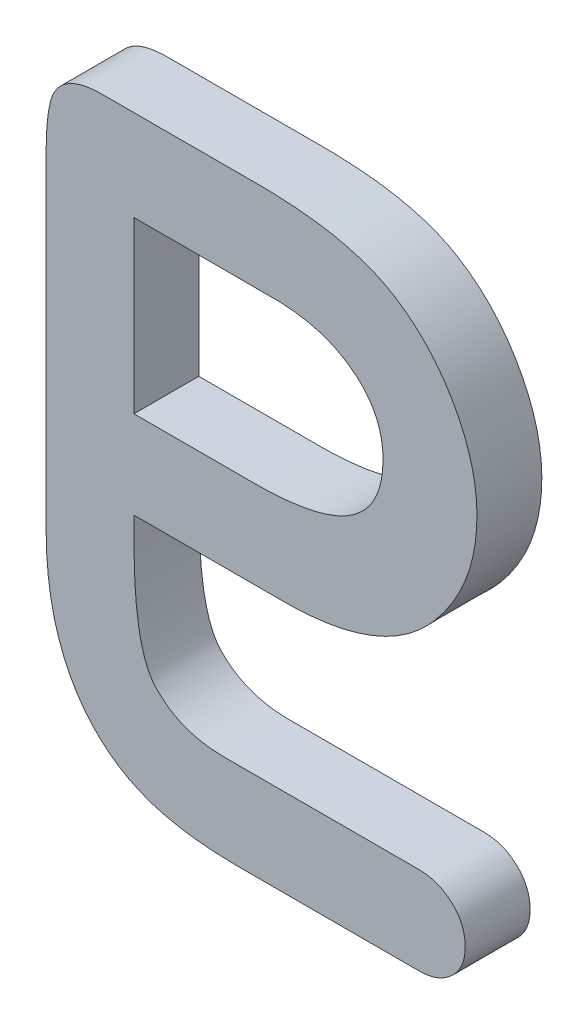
ISO-10303-21;
HEADER;
FILE_DESCRIPTION(('STEP AP214'),'2;1');
FILE_NAME('part.step','',(''),(''),'','','');
FILE_SCHEMA(('AUTOMOTIVE_DESIGN { 1 0 10303 214 1 1 1 1 }'));
ENDSEC;
DATA;
#1=APPLICATION_CONTEXT('core data for automotive mechanical design processes');
#2=APPLICATION_PROTOCOL_DEFINITION('international standard','automotive_design',2000,#1);
#3=PRODUCT_CONTEXT('',#1,'mechanical');
#4=PRODUCT('Part','Part','',(#3));
#5=PRODUCT_RELATED_PRODUCT_CATEGORY('part','',(#4));
#6=PRODUCT_DEFINITION_FORMATION('','',#4);
#7=PRODUCT_DEFINITION_CONTEXT('part definition',#1,'design');
#8=PRODUCT_DEFINITION('design','',#6,#7);
#9=PRODUCT_DEFINITION_SHAPE('','',#8);
#10=(LENGTH_UNIT() NAMED_UNIT(*) SI_UNIT(.MILLI.,.METRE.));
#11=(NAMED_UNIT(*) PLANE_ANGLE_UNIT() SI_UNIT($,.RADIAN.));
#12=(NAMED_UNIT(*) SI_UNIT($,.STERADIAN.) SOLID_ANGLE_UNIT());
#13=UNCERTAINTY_MEASURE_WITH_UNIT(LENGTH_MEASURE(1.E-05),#10,'distance_accuracy_value','');
#14=(GEOMETRIC_REPRESENTATION_CONTEXT(3) GLOBAL_UNCERTAINTY_ASSIGNED_CONTEXT((#13)) GLOBAL_UNIT_ASSIGNED_CONTEXT((#10,
#11,#12)) REPRESENTATION_CONTEXT('',''));
#15=CARTESIAN_POINT('',(0.,0.,0.));
#16=DIRECTION('',(0.,0.,1.));
#17=DIRECTION('',(1.,0.,0.));
#18=AXIS2_PLACEMENT_3D('',#15,#16,#17);
#19=CARTESIAN_POINT('',(44.8592131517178,1.21161594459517,0.500000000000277));
#20=CARTESIAN_POINT('',(44.8592131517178,1.07828261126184,0.500000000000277));
#21=CARTESIAN_POINT('',(44.8609006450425,0.944970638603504,0.500000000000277));
#22=CARTESIAN_POINT('',(44.8687369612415,0.325901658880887,0.500000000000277));
#23=CARTESIAN_POINT('',(45.020718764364,0.1546545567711,0.500000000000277));
#24=CARTESIAN_POINT('',(45.2068321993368,-0.0550507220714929,0.500000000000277));
#25=CARTESIAN_POINT('',(45.5592131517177,-0.0550507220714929,0.500000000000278));
#26=CARTESIAN_POINT('',(46.3044512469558,-0.0550507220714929,0.500000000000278));
#27=CARTESIAN_POINT('',(47.0496893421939,-0.0550507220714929,0.500000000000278));
#28=CARTESIAN_POINT('',(47.1639750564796,-0.0550507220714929,0.500000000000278));
#29=CARTESIAN_POINT('',(47.2411322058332,-0.101048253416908,0.500000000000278));
#30=CARTESIAN_POINT('',(47.4115941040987,-0.202669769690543,0.500000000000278));
#31=CARTESIAN_POINT('',(47.4115941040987,-0.393145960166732,0.500000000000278));
#32=CARTESIAN_POINT('',(47.4115941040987,-0.583622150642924,0.500000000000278));
#33=CARTESIAN_POINT('',(47.2411322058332,-0.685243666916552,0.500000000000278));
#34=CARTESIAN_POINT('',(47.1639750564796,-0.731241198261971,0.500000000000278));
#35=CARTESIAN_POINT('',(47.0496893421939,-0.73124119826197,0.500000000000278));
#36=CARTESIAN_POINT('',(46.3663560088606,-0.731241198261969,0.500000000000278));
#37=CARTESIAN_POINT('',(45.6830226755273,-0.73124119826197,0.500000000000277));
#38=CARTESIAN_POINT('',(45.2639750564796,-0.73124119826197,0.500000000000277));
#39=CARTESIAN_POINT('',(44.997308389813,-0.643145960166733,0.500000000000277));
#40=CARTESIAN_POINT('',(44.7306417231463,-0.555050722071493,0.500000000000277));
#41=CARTESIAN_POINT('',(44.5466213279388,-0.358228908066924,0.500000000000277));
#42=B_SPLINE_CURVE_WITH_KNOTS('',2,(#19,#20,#21,#22,#23,#24,#25,#26,#27,#28,#29,#30,#31,#32,#33,
#34,#35,#36,#37,#38,#39,#40,#41),.UNSPECIFIED.,.F.,.F.,(3,2,2,2,2,2,2,2,2,2,2,3),(0.,1.,2.,3.,
4.,5.,6.,7.,8.,9.,10.,11.),.UNSPECIFIED.);
#43=DIRECTION('',(0.,0.,-1.));
#44=VECTOR('',#43,1.);
#45=SURFACE_OF_LINEAR_EXTRUSION('',#42,#44);
#46=CARTESIAN_POINT('',(44.8592131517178,1.21161594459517,2.77266727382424E-13));
#47=CARTESIAN_POINT('',(44.8592131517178,1.07828261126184,2.77266727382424E-13));
#48=CARTESIAN_POINT('',(44.8609006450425,0.944970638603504,2.77266934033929E-13));
#49=CARTESIAN_POINT('',(44.8687369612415,0.325901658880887,2.7726789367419E-13));
#50=CARTESIAN_POINT('',(45.020718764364,0.1546545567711,2.77286505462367E-13));
#51=CARTESIAN_POINT('',(45.2068321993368,-0.0550507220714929,2.77309297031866E-13));
#52=CARTESIAN_POINT('',(45.5592131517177,-0.0550507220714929,2.77352449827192E-13));
#53=CARTESIAN_POINT('',(46.3044512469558,-0.0550507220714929,2.77443712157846E-13));
#54=CARTESIAN_POINT('',(47.0496893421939,-0.0550507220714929,2.775349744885E-13));
#55=CARTESIAN_POINT('',(47.1639750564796,-0.0550507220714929,2.77548969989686E-13));
#56=CARTESIAN_POINT('',(47.2411322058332,-0.101048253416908,2.7755841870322E-13));
#57=CARTESIAN_POINT('',(47.4115941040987,-0.202669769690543,2.7757929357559E-13));
#58=CARTESIAN_POINT('',(47.4115941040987,-0.393145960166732,2.7757929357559E-13));
#59=CARTESIAN_POINT('',(47.4115941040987,-0.583622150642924,2.7757929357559E-13));
#60=CARTESIAN_POINT('',(47.2411322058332,-0.685243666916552,2.7755841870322E-13));
#61=CARTESIAN_POINT('',(47.1639750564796,-0.731241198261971,2.77548969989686E-13));
#62=CARTESIAN_POINT('',(47.0496893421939,-0.73124119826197,2.775349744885E-13));
#63=CARTESIAN_POINT('',(46.3663560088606,-0.731241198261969,2.77451293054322E-13));
#64=CARTESIAN_POINT('',(45.6830226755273,-0.73124119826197,2.77367611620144E-13));
#65=CARTESIAN_POINT('',(45.2639750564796,-0.73124119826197,2.77316294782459E-13));
#66=CARTESIAN_POINT('',(44.997308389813,-0.643145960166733,2.77283638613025E-13));
#67=CARTESIAN_POINT('',(44.7306417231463,-0.555050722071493,2.77250982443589E-13));
#68=CARTESIAN_POINT('',(44.5466213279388,-0.358228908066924,2.77228447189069E-13));
#69=B_SPLINE_CURVE_WITH_KNOTS('',2,(#46,#47,#48,#49,#50,#51,#52,#53,#54,#55,#56,#57,#58,#59,#60,
#61,#62,#63,#64,#65,#66,#67,#68),.UNSPECIFIED.,.F.,.F.,(3,2,2,2,2,2,2,2,2,2,2,3),(0.,1.,2.,3.,
4.,5.,6.,7.,8.,9.,10.,11.),.UNSPECIFIED.);
#70=CARTESIAN_POINT('',(44.8592131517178,1.21161594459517,2.77266727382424E-13));
#71=VERTEX_POINT('',#70);
#72=CARTESIAN_POINT('',(44.5466213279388,-0.358228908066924,2.77228447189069E-13));
#73=VERTEX_POINT('',#72);
#74=EDGE_CURVE('E74',#71,#73,#69,.T.);
#75=ORIENTED_EDGE('',*,*,#74,.F.);
#76=DIRECTION('',(0.,0.,-1.));
#77=VECTOR('',#76,1.);
#78=CARTESIAN_POINT('',(44.8592131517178,1.21161594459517,0.500000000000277));
#79=LINE('',#78,#77);
#80=CARTESIAN_POINT('',(44.8592131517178,1.21161594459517,0.500000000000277));
#81=VERTEX_POINT('',#80);
#82=EDGE_CURVE('E27',#81,#71,#79,.T.);
#83=ORIENTED_EDGE('',*,*,#82,.F.);
#84=CARTESIAN_POINT('',(44.5466213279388,-0.358228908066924,0.500000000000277));
#85=VERTEX_POINT('',#84);
#86=EDGE_CURVE('E128',#81,#85,#42,.T.);
#87=ORIENTED_EDGE('',*,*,#86,.T.);
#88=DIRECTION('',(0.,0.,-1.));
#89=VECTOR('',#88,1.);
#90=CARTESIAN_POINT('',(44.5466213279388,-0.358228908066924,0.500000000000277));
#91=LINE('',#90,#89);
#92=EDGE_CURVE('E11',#85,#73,#91,.T.);
#93=ORIENTED_EDGE('',*,*,#92,.T.);
#94=EDGE_LOOP('',(#75,#83,#87,#93));
#95=FACE_BOUND('',#94,.T.);
#96=ADVANCED_FACE('F16',(#95),#45,.T.);
#97=CARTESIAN_POINT('',(44.8592131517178,1.88780642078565,0.500000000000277));
#98=CARTESIAN_POINT('',(45.3234988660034,1.88780642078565,0.500000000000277));
#99=CARTESIAN_POINT('',(45.7877845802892,1.88780642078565,0.500000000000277));
#100=CARTESIAN_POINT('',(46.2925464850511,1.88780642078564,0.500000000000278));
#101=CARTESIAN_POINT('',(46.5354036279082,2.04971118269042,0.500000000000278));
#102=CARTESIAN_POINT('',(46.7782607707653,2.21161594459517,0.500000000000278));
#103=CARTESIAN_POINT('',(46.7782607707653,2.54494927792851,0.500000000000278));
#104=CARTESIAN_POINT('',(46.7782607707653,2.87828261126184,0.500000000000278));
#105=CARTESIAN_POINT('',(46.4818770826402,3.06215026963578,0.500000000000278));
#106=CARTESIAN_POINT('',(46.2639750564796,3.19733023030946,0.500000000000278));
#107=CARTESIAN_POINT('',(45.9258798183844,3.19733023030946,0.500000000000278));
#108=CARTESIAN_POINT('',(45.3925464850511,3.19733023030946,0.500000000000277));
#109=CARTESIAN_POINT('',(44.8592131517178,3.19733023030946,0.500000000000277));
#110=B_SPLINE_CURVE_WITH_KNOTS('',2,(#97,#98,#99,#100,#101,#102,#103,#104,#105,#106,#107,#108,
#109),.UNSPECIFIED.,.F.,.F.,(3,2,2,2,2,2,3),(1.,2.,3.,4.,5.,6.,7.),.UNSPECIFIED.);
#111=DIRECTION('',(0.,0.,-1.));
#112=VECTOR('',#111,1.);
#113=SURFACE_OF_LINEAR_EXTRUSION('',#110,#112);
#114=CARTESIAN_POINT('',(44.8592131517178,1.88780642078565,2.77266727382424E-13));
#115=CARTESIAN_POINT('',(45.3234988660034,1.88780642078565,2.77323584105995E-13));
#116=CARTESIAN_POINT('',(45.7877845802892,1.88780642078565,2.77380440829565E-13));
#117=CARTESIAN_POINT('',(46.2925464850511,1.88780642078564,2.77442254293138E-13));
#118=CARTESIAN_POINT('',(46.5354036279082,2.04971118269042,2.7747199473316E-13));
#119=CARTESIAN_POINT('',(46.7782607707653,2.21161594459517,2.77501735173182E-13));
#120=CARTESIAN_POINT('',(46.7782607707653,2.54494927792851,2.77501735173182E-13));
#121=CARTESIAN_POINT('',(46.7782607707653,2.87828261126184,2.77501735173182E-13));
#122=CARTESIAN_POINT('',(46.4818770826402,3.06215026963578,2.77465439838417E-13));
#123=CARTESIAN_POINT('',(46.2639750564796,3.19733023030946,2.77438755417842E-13));
#124=CARTESIAN_POINT('',(45.9258798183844,3.19733023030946,2.77397352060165E-13));
#125=CARTESIAN_POINT('',(45.3925464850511,3.19733023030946,2.77332039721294E-13));
#126=CARTESIAN_POINT('',(44.8592131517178,3.19733023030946,2.77266727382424E-13));
#127=B_SPLINE_CURVE_WITH_KNOTS('',2,(#114,#115,#116,#117,#118,#119,#120,#121,#122,#123,#124,
#125,#126),.UNSPECIFIED.,.F.,.F.,(3,2,2,2,2,2,3),(1.,2.,3.,4.,5.,6.,7.),.UNSPECIFIED.);
#128=CARTESIAN_POINT('',(44.8592131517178,1.88780642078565,2.77266727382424E-13));
#129=VERTEX_POINT('',#128);
#130=CARTESIAN_POINT('',(44.8592131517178,3.19733023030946,2.77266727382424E-13));
#131=VERTEX_POINT('',#130);
#132=EDGE_CURVE('E61',#129,#131,#127,.T.);
#133=ORIENTED_EDGE('',*,*,#132,.F.);
#134=DIRECTION('',(0.,0.,-1.));
#135=VECTOR('',#134,1.);
#136=CARTESIAN_POINT('',(44.8592131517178,1.88780642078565,0.500000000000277));
#137=LINE('',#136,#135);
#138=CARTESIAN_POINT('',(44.8592131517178,1.88780642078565,0.500000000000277));
#139=VERTEX_POINT('',#138);
#140=EDGE_CURVE('E68',#139,#129,#137,.T.);
#141=ORIENTED_EDGE('',*,*,#140,.F.);
#142=CARTESIAN_POINT('',(44.8592131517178,3.19733023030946,0.500000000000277));
#143=VERTEX_POINT('',#142);
#144=EDGE_CURVE('E63',#139,#143,#110,.T.);
#145=ORIENTED_EDGE('',*,*,#144,.T.);
#146=DIRECTION('',(0.,0.,-1.));
#147=VECTOR('',#146,1.);
#148=CARTESIAN_POINT('',(44.8592131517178,3.19733023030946,0.500000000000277));
#149=LINE('',#148,#147);
#150=EDGE_CURVE('E21',#143,#131,#149,.T.);
#151=ORIENTED_EDGE('',*,*,#150,.T.);
#152=EDGE_LOOP('',(#133,#141,#145,#151));
#153=FACE_BOUND('',#152,.T.);
#154=ADVANCED_FACE('F18',(#153),#113,.T.);
#155=CARTESIAN_POINT('',(44.8592131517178,3.19733023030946,0.500000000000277));
#156=DIRECTION('',(1.,0.,0.));
#157=DIRECTION('',(0.,1.,0.));
#158=AXIS2_PLACEMENT_3D('',#155,#156,#157);
#159=PLANE('',#158);
#160=CARTESIAN_POINT('',(44.8592131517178,3.19733023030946,2.77266727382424E-13));
#161=CARTESIAN_POINT('',(44.8592131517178,2.54256832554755,2.77266727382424E-13));
#162=CARTESIAN_POINT('',(44.8592131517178,1.88780642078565,2.77266727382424E-13));
#163=B_SPLINE_CURVE_WITH_KNOTS('',2,(#160,#161,#162),.UNSPECIFIED.,.F.,.F.,(3,3),(0.,1.),.UNSPECIFIED.);
#164=EDGE_CURVE('E70',#131,#129,#163,.T.);
#165=ORIENTED_EDGE('',*,*,#164,.F.);
#166=ORIENTED_EDGE('',*,*,#150,.F.);
#167=CARTESIAN_POINT('',(44.8592131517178,3.19733023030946,0.500000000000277));
#168=CARTESIAN_POINT('',(44.8592131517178,2.54256832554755,0.500000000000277));
#169=CARTESIAN_POINT('',(44.8592131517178,1.88780642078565,0.500000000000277));
#170=B_SPLINE_CURVE_WITH_KNOTS('',2,(#167,#168,#169),.UNSPECIFIED.,.F.,.F.,(3,3),(0.,1.),.UNSPECIFIED.);
#171=EDGE_CURVE('E120',#143,#139,#170,.T.);
#172=ORIENTED_EDGE('',*,*,#171,.T.);
#173=ORIENTED_EDGE('',*,*,#140,.T.);
#174=EDGE_LOOP('',(#165,#166,#172,#173));
#175=FACE_BOUND('',#174,.T.);
#176=ADVANCED_FACE('F71',(#175),#159,.T.);
#177=CARTESIAN_POINT('',(44.5466213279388,-0.358228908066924,0.500000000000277));
#178=CARTESIAN_POINT('',(44.1830226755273,0.0306635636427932,0.500000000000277));
#179=CARTESIAN_POINT('',(44.1830226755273,0.773520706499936,0.500000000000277));
#180=CARTESIAN_POINT('',(44.1830226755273,2.03304451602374,0.500000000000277));
#181=CARTESIAN_POINT('',(44.1830226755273,3.29256832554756,0.500000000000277));
#182=CARTESIAN_POINT('',(44.1830226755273,3.60209213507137,0.500000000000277));
#183=CARTESIAN_POINT('',(44.2411179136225,3.71828261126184,0.500000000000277));
#184=CARTESIAN_POINT('',(44.3306417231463,3.89733023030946,0.500000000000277));
#185=CARTESIAN_POINT('',(44.6211179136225,3.89733023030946,0.500000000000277));
#186=CARTESIAN_POINT('',(45.2139750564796,3.89733023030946,0.500000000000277));
#187=CARTESIAN_POINT('',(45.8068321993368,3.89733023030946,0.500000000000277));
#188=CARTESIAN_POINT('',(46.4830226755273,3.89733023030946,0.500000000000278));
#189=CARTESIAN_POINT('',(46.8302750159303,3.69669554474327,0.500000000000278));
#190=CARTESIAN_POINT('',(47.1258798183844,3.52590165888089,0.500000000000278));
#191=CARTESIAN_POINT('',(47.3113061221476,3.20668675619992,0.500000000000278));
#192=CARTESIAN_POINT('',(47.5020702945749,2.87828261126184,0.500000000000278));
#193=CARTESIAN_POINT('',(47.5020702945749,2.53066356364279,0.500000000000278));
#194=CARTESIAN_POINT('',(47.5020702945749,2.03542546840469,0.500000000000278));
#195=CARTESIAN_POINT('',(47.1578230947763,1.64617863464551,0.500000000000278));
#196=CARTESIAN_POINT('',(46.7734988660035,1.21161594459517,0.500000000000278));
#197=CARTESIAN_POINT('',(46.0115941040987,1.21161594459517,0.500000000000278));
#198=CARTESIAN_POINT('',(45.4354036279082,1.21161594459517,0.500000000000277));
#199=CARTESIAN_POINT('',(44.8592131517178,1.21161594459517,0.500000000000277));
#200=B_SPLINE_CURVE_WITH_KNOTS('',2,(#177,#178,#179,#180,#181,#182,#183,#184,#185,#186,#187,
#188,#189,#190,#191,#192,#193,#194,#195,#196,#197,#198,#199),.UNSPECIFIED.,.F.,.F.,(3,2,2,2,2,2,
2,2,2,2,2,3),(11.,12.,13.,14.,15.,16.,17.,18.,19.,20.,21.,22.),.UNSPECIFIED.);
#201=DIRECTION('',(0.,0.,-1.));
#202=VECTOR('',#201,1.);
#203=SURFACE_OF_LINEAR_EXTRUSION('',#200,#202);
#204=CARTESIAN_POINT('',(44.5466213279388,-0.358228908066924,2.77228447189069E-13));
#205=CARTESIAN_POINT('',(44.1830226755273,0.0306635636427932,2.7718392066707E-13));
#206=CARTESIAN_POINT('',(44.1830226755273,0.773520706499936,2.7718392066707E-13));
#207=CARTESIAN_POINT('',(44.1830226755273,2.03304451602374,2.7718392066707E-13));
#208=CARTESIAN_POINT('',(44.1830226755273,3.29256832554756,2.7718392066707E-13));
#209=CARTESIAN_POINT('',(44.1830226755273,3.60209213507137,2.7718392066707E-13));
#210=CARTESIAN_POINT('',(44.2411179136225,3.71828261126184,2.7719103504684E-13));
#211=CARTESIAN_POINT('',(44.3306417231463,3.89733023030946,2.77201998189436E-13));
#212=CARTESIAN_POINT('',(44.6211179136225,3.89733023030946,2.77237570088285E-13));
#213=CARTESIAN_POINT('',(45.2139750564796,3.89733023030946,2.7731017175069E-13));
#214=CARTESIAN_POINT('',(45.8068321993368,3.89733023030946,2.77382773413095E-13));
#215=CARTESIAN_POINT('',(46.4830226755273,3.89733023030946,2.77465580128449E-13));
#216=CARTESIAN_POINT('',(46.8302750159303,3.69669554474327,2.77508104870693E-13));
#217=CARTESIAN_POINT('',(47.1258798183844,3.52590165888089,2.77544304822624E-13));
#218=CARTESIAN_POINT('',(47.3113061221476,3.20668675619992,2.77567012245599E-13));
#219=CARTESIAN_POINT('',(47.5020702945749,2.87828261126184,2.77590373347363E-13));
#220=CARTESIAN_POINT('',(47.5020702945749,2.53066356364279,2.77590373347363E-13));
#221=CARTESIAN_POINT('',(47.5020702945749,2.03542546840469,2.77590373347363E-13));
#222=CARTESIAN_POINT('',(47.1578230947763,1.64617863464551,2.77548216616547E-13));
#223=CARTESIAN_POINT('',(46.7734988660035,1.21161594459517,2.77501152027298E-13));
#224=CARTESIAN_POINT('',(46.0115941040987,1.21161594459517,2.77407848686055E-13));
#225=CARTESIAN_POINT('',(45.4354036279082,1.21161594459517,2.7733728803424E-13));
#226=CARTESIAN_POINT('',(44.8592131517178,1.21161594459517,2.77266727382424E-13));
#227=B_SPLINE_CURVE_WITH_KNOTS('',2,(#204,#205,#206,#207,#208,#209,#210,#211,#212,#213,#214,
#215,#216,#217,#218,#219,#220,#221,#222,#223,#224,#225,#226),.UNSPECIFIED.,.F.,.F.,(3,2,2,2,2,2,
2,2,2,2,2,3),(11.,12.,13.,14.,15.,16.,17.,18.,19.,20.,21.,22.),.UNSPECIFIED.);
#228=EDGE_CURVE('E104',#73,#71,#227,.T.);
#229=ORIENTED_EDGE('',*,*,#228,.F.);
#230=ORIENTED_EDGE('',*,*,#92,.F.);
#231=EDGE_CURVE('E137',#85,#81,#200,.T.);
#232=ORIENTED_EDGE('',*,*,#231,.T.);
#233=ORIENTED_EDGE('',*,*,#82,.T.);
#234=EDGE_LOOP('',(#229,#230,#232,#233));
#235=FACE_BOUND('',#234,.T.);
#236=ADVANCED_FACE('F148',(#235),#203,.T.);
#237=CARTESIAN_POINT('',(47.3689786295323,-0.224883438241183,0.500000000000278));
#238=DIRECTION('',(0.,0.,-1.));
#239=DIRECTION('',(-0.948007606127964,0.318247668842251,0.));
#240=AXIS2_PLACEMENT_3D('',#237,#238,#239);
#241=PLANE('',#240);
#242=ORIENTED_EDGE('',*,*,#144,.F.);
#243=ORIENTED_EDGE('',*,*,#171,.F.);
#244=EDGE_LOOP('',(#242,#243));
#245=FACE_BOUND('',#244,.T.);
#246=ORIENTED_EDGE('',*,*,#86,.F.);
#247=ORIENTED_EDGE('',*,*,#231,.F.);
#248=EDGE_LOOP('',(#246,#247));
#249=FACE_BOUND('',#248,.T.);
#250=ADVANCED_FACE('F156',(#245,#249),#241,.F.);
#251=CARTESIAN_POINT('',(47.3689786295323,-0.224883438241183,2.77574074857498E-13));
#252=DIRECTION('',(0.,0.,-1.));
#253=DIRECTION('',(-0.948007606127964,0.318247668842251,0.));
#254=AXIS2_PLACEMENT_3D('',#251,#252,#253);
#255=PLANE('',#254);
#256=ORIENTED_EDGE('',*,*,#132,.T.);
#257=ORIENTED_EDGE('',*,*,#164,.T.);
#258=EDGE_LOOP('',(#256,#257));
#259=FACE_BOUND('',#258,.T.);
#260=ORIENTED_EDGE('',*,*,#74,.T.);
#261=ORIENTED_EDGE('',*,*,#228,.T.);
#262=EDGE_LOOP('',(#260,#261));
#263=FACE_BOUND('',#262,.T.);
#264=ADVANCED_FACE('F76',(#259,#263),#255,.T.);
#265=CLOSED_SHELL('',(#96,#154,#176,#236,#250,#264));
#266=MANIFOLD_SOLID_BREP('B1',#265);
#267=ADVANCED_BREP_SHAPE_REPRESENTATION('',(#18,#266),#14);
#268=SHAPE_DEFINITION_REPRESENTATION(#9,#267);
ENDSEC;
END-ISO-10303-21;
